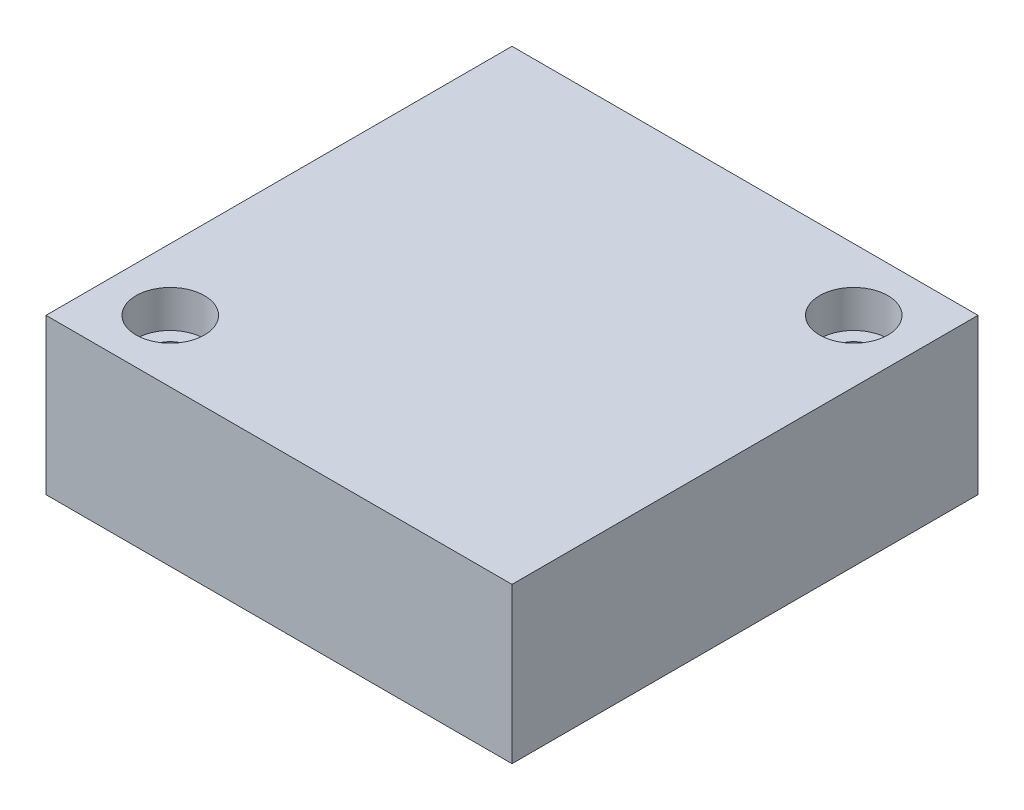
ISO-10303-21;
HEADER;
FILE_DESCRIPTION(('STEP AP214'),'2;1');
FILE_NAME('part.step','',(''),(''),'','','');
FILE_SCHEMA(('AUTOMOTIVE_DESIGN { 1 0 10303 214 1 1 1 1 }'));
ENDSEC;
DATA;
#1=APPLICATION_CONTEXT('core data for automotive mechanical design processes');
#2=APPLICATION_PROTOCOL_DEFINITION('international standard','automotive_design',2000,#1);
#3=PRODUCT_CONTEXT('',#1,'mechanical');
#4=PRODUCT('Part','Part','',(#3));
#5=PRODUCT_RELATED_PRODUCT_CATEGORY('part','',(#4));
#6=PRODUCT_DEFINITION_FORMATION('','',#4);
#7=PRODUCT_DEFINITION_CONTEXT('part definition',#1,'design');
#8=PRODUCT_DEFINITION('design','',#6,#7);
#9=PRODUCT_DEFINITION_SHAPE('','',#8);
#10=(LENGTH_UNIT() NAMED_UNIT(*) SI_UNIT(.MILLI.,.METRE.));
#11=(NAMED_UNIT(*) PLANE_ANGLE_UNIT() SI_UNIT($,.RADIAN.));
#12=(NAMED_UNIT(*) SI_UNIT($,.STERADIAN.) SOLID_ANGLE_UNIT());
#13=UNCERTAINTY_MEASURE_WITH_UNIT(LENGTH_MEASURE(1.E-05),#10,'distance_accuracy_value','');
#14=(GEOMETRIC_REPRESENTATION_CONTEXT(3) GLOBAL_UNCERTAINTY_ASSIGNED_CONTEXT((#13)) GLOBAL_UNIT_ASSIGNED_CONTEXT((#10,
#11,#12)) REPRESENTATION_CONTEXT('',''));
#15=CARTESIAN_POINT('',(0.,0.,0.));
#16=DIRECTION('',(0.,0.,1.));
#17=DIRECTION('',(1.,0.,0.));
#18=AXIS2_PLACEMENT_3D('',#15,#16,#17);
#19=CARTESIAN_POINT('',(37.5,25.,37.5));
#20=DIRECTION('',(-1.,0.,0.));
#21=DIRECTION('',(0.,0.,1.));
#22=AXIS2_PLACEMENT_3D('',#19,#20,#21);
#23=PLANE('',#22);
#24=DIRECTION('',(0.,0.,-1.));
#25=VECTOR('',#24,1.);
#26=CARTESIAN_POINT('',(37.5,0.,37.5));
#27=LINE('',#26,#25);
#28=CARTESIAN_POINT('',(37.5,0.,37.5));
#29=VERTEX_POINT('',#28);
#30=CARTESIAN_POINT('',(37.5,0.,-37.5));
#31=VERTEX_POINT('',#30);
#32=EDGE_CURVE('E113',#29,#31,#27,.T.);
#33=ORIENTED_EDGE('',*,*,#32,.T.);
#34=DIRECTION('',(0.,-1.,0.));
#35=VECTOR('',#34,1.);
#36=CARTESIAN_POINT('',(37.5,25.,-37.5));
#37=LINE('',#36,#35);
#38=CARTESIAN_POINT('',(37.5,25.,-37.5));
#39=VERTEX_POINT('',#38);
#40=EDGE_CURVE('E11',#39,#31,#37,.T.);
#41=ORIENTED_EDGE('',*,*,#40,.F.);
#42=DIRECTION('',(0.,0.,-1.));
#43=VECTOR('',#42,1.);
#44=CARTESIAN_POINT('',(37.5,25.,37.5));
#45=LINE('',#44,#43);
#46=CARTESIAN_POINT('',(37.5,25.,37.5));
#47=VERTEX_POINT('',#46);
#48=EDGE_CURVE('E97',#47,#39,#45,.T.);
#49=ORIENTED_EDGE('',*,*,#48,.F.);
#50=DIRECTION('',(0.,-1.,0.));
#51=VECTOR('',#50,1.);
#52=CARTESIAN_POINT('',(37.5,25.,37.5));
#53=LINE('',#52,#51);
#54=EDGE_CURVE('E109',#47,#29,#53,.T.);
#55=ORIENTED_EDGE('',*,*,#54,.T.);
#56=EDGE_LOOP('',(#33,#41,#49,#55));
#57=FACE_BOUND('',#56,.T.);
#58=ADVANCED_FACE('F45',(#57),#23,.F.);
#59=CARTESIAN_POINT('',(-37.5,25.,-37.5));
#60=DIRECTION('',(0.,0.,1.));
#61=DIRECTION('',(1.,0.,0.));
#62=AXIS2_PLACEMENT_3D('',#59,#60,#61);
#63=PLANE('',#62);
#64=DIRECTION('',(-1.,0.,0.));
#65=VECTOR('',#64,1.);
#66=CARTESIAN_POINT('',(-37.5,0.,-37.5));
#67=LINE('',#66,#65);
#68=CARTESIAN_POINT('',(-37.5,0.,-37.5));
#69=VERTEX_POINT('',#68);
#70=EDGE_CURVE('E102',#31,#69,#67,.T.);
#71=ORIENTED_EDGE('',*,*,#70,.T.);
#72=DIRECTION('',(0.,-1.,0.));
#73=VECTOR('',#72,1.);
#74=CARTESIAN_POINT('',(-37.5,25.,-37.5));
#75=LINE('',#74,#73);
#76=CARTESIAN_POINT('',(-37.5,25.,-37.5));
#77=VERTEX_POINT('',#76);
#78=EDGE_CURVE('E54',#77,#69,#75,.T.);
#79=ORIENTED_EDGE('',*,*,#78,.F.);
#80=DIRECTION('',(-1.,0.,0.));
#81=VECTOR('',#80,1.);
#82=CARTESIAN_POINT('',(-37.5,25.,-37.5));
#83=LINE('',#82,#81);
#84=EDGE_CURVE('E92',#39,#77,#83,.T.);
#85=ORIENTED_EDGE('',*,*,#84,.F.);
#86=ORIENTED_EDGE('',*,*,#40,.T.);
#87=EDGE_LOOP('',(#71,#79,#85,#86));
#88=FACE_BOUND('',#87,.T.);
#89=ADVANCED_FACE('F101',(#88),#63,.F.);
#90=CARTESIAN_POINT('',(-37.5,25.,37.5));
#91=DIRECTION('',(1.,0.,0.));
#92=DIRECTION('',(0.,0.,-1.));
#93=AXIS2_PLACEMENT_3D('',#90,#91,#92);
#94=PLANE('',#93);
#95=DIRECTION('',(0.,0.,1.));
#96=VECTOR('',#95,1.);
#97=CARTESIAN_POINT('',(-37.5,0.,37.5));
#98=LINE('',#97,#96);
#99=CARTESIAN_POINT('',(-37.5,0.,37.5));
#100=VERTEX_POINT('',#99);
#101=EDGE_CURVE('E79',#69,#100,#98,.T.);
#102=ORIENTED_EDGE('',*,*,#101,.T.);
#103=DIRECTION('',(0.,-1.,0.));
#104=VECTOR('',#103,1.);
#105=CARTESIAN_POINT('',(-37.5,25.,37.5));
#106=LINE('',#105,#104);
#107=CARTESIAN_POINT('',(-37.5,25.,37.5));
#108=VERTEX_POINT('',#107);
#109=EDGE_CURVE('E104',#108,#100,#106,.T.);
#110=ORIENTED_EDGE('',*,*,#109,.F.);
#111=DIRECTION('',(0.,0.,1.));
#112=VECTOR('',#111,1.);
#113=CARTESIAN_POINT('',(-37.5,25.,37.5));
#114=LINE('',#113,#112);
#115=EDGE_CURVE('E95',#77,#108,#114,.T.);
#116=ORIENTED_EDGE('',*,*,#115,.F.);
#117=ORIENTED_EDGE('',*,*,#78,.T.);
#118=EDGE_LOOP('',(#102,#110,#116,#117));
#119=FACE_BOUND('',#118,.T.);
#120=ADVANCED_FACE('F105',(#119),#94,.F.);
#121=CARTESIAN_POINT('',(-37.5,25.,37.5));
#122=DIRECTION('',(0.,0.,-1.));
#123=DIRECTION('',(-1.,0.,0.));
#124=AXIS2_PLACEMENT_3D('',#121,#122,#123);
#125=PLANE('',#124);
#126=DIRECTION('',(1.,0.,0.));
#127=VECTOR('',#126,1.);
#128=CARTESIAN_POINT('',(-37.5,0.,37.5));
#129=LINE('',#128,#127);
#130=EDGE_CURVE('E85',#100,#29,#129,.T.);
#131=ORIENTED_EDGE('',*,*,#130,.T.);
#132=ORIENTED_EDGE('',*,*,#54,.F.);
#133=DIRECTION('',(1.,0.,0.));
#134=VECTOR('',#133,1.);
#135=CARTESIAN_POINT('',(-37.5,25.,37.5));
#136=LINE('',#135,#134);
#137=EDGE_CURVE('E62',#108,#47,#136,.T.);
#138=ORIENTED_EDGE('',*,*,#137,.F.);
#139=ORIENTED_EDGE('',*,*,#109,.T.);
#140=EDGE_LOOP('',(#131,#132,#138,#139));
#141=FACE_BOUND('',#140,.T.);
#142=ADVANCED_FACE('F127',(#141),#125,.F.);
#143=CARTESIAN_POINT('',(0.,25.,0.));
#144=DIRECTION('',(0.,-1.,0.));
#145=DIRECTION('',(0.,0.,-1.));
#146=AXIS2_PLACEMENT_3D('',#143,#144,#145);
#147=PLANE('',#146);
#148=CARTESIAN_POINT('',(-27.5,25.,27.5));
#149=DIRECTION('',(0.,1.,0.));
#150=DIRECTION('',(0.,0.,1.));
#151=AXIS2_PLACEMENT_3D('',#148,#149,#150);
#152=CIRCLE('',#151,5.5);
#153=CARTESIAN_POINT('',(-27.5,25.,33.));
#154=VERTEX_POINT('',#153);
#155=EDGE_CURVE('E161',#154,#154,#152,.T.);
#156=ORIENTED_EDGE('',*,*,#155,.F.);
#157=EDGE_LOOP('',(#156));
#158=FACE_BOUND('',#157,.T.);
#159=CARTESIAN_POINT('',(27.5,25.,-27.5));
#160=DIRECTION('',(0.,1.,0.));
#161=DIRECTION('',(0.,0.,1.));
#162=AXIS2_PLACEMENT_3D('',#159,#160,#161);
#163=CIRCLE('',#162,5.5);
#164=CARTESIAN_POINT('',(27.5,25.,-22.));
#165=VERTEX_POINT('',#164);
#166=EDGE_CURVE('E145',#165,#165,#163,.T.);
#167=ORIENTED_EDGE('',*,*,#166,.F.);
#168=EDGE_LOOP('',(#167));
#169=FACE_BOUND('',#168,.T.);
#170=ORIENTED_EDGE('',*,*,#48,.T.);
#171=ORIENTED_EDGE('',*,*,#84,.T.);
#172=ORIENTED_EDGE('',*,*,#115,.T.);
#173=ORIENTED_EDGE('',*,*,#137,.T.);
#174=EDGE_LOOP('',(#170,#171,#172,#173));
#175=FACE_BOUND('',#174,.T.);
#176=ADVANCED_FACE('F93',(#158,#169,#175),#147,.F.);
#177=CARTESIAN_POINT('',(0.,0.,0.));
#178=DIRECTION('',(0.,-1.,0.));
#179=DIRECTION('',(0.,0.,-1.));
#180=AXIS2_PLACEMENT_3D('',#177,#178,#179);
#181=PLANE('',#180);
#182=CARTESIAN_POINT('',(-27.5,0.,27.5));
#183=DIRECTION('',(0.,1.,0.));
#184=DIRECTION('',(0.,0.,1.));
#185=AXIS2_PLACEMENT_3D('',#182,#183,#184);
#186=CIRCLE('',#185,3.29999999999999);
#187=CARTESIAN_POINT('',(-27.5,0.,30.8));
#188=VERTEX_POINT('',#187);
#189=EDGE_CURVE('E149',#188,#188,#186,.T.);
#190=ORIENTED_EDGE('',*,*,#189,.T.);
#191=EDGE_LOOP('',(#190));
#192=FACE_BOUND('',#191,.T.);
#193=CARTESIAN_POINT('',(27.5,0.,-27.5));
#194=DIRECTION('',(0.,1.,0.));
#195=DIRECTION('',(0.,0.,1.));
#196=AXIS2_PLACEMENT_3D('',#193,#194,#195);
#197=CIRCLE('',#196,3.29999999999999);
#198=CARTESIAN_POINT('',(27.5,0.,-24.2));
#199=VERTEX_POINT('',#198);
#200=EDGE_CURVE('E117',#199,#199,#197,.T.);
#201=ORIENTED_EDGE('',*,*,#200,.T.);
#202=EDGE_LOOP('',(#201));
#203=FACE_BOUND('',#202,.T.);
#204=ORIENTED_EDGE('',*,*,#32,.F.);
#205=ORIENTED_EDGE('',*,*,#130,.F.);
#206=ORIENTED_EDGE('',*,*,#101,.F.);
#207=ORIENTED_EDGE('',*,*,#70,.F.);
#208=EDGE_LOOP('',(#204,#205,#206,#207));
#209=FACE_BOUND('',#208,.T.);
#210=ADVANCED_FACE('F130',(#192,#203,#209),#181,.T.);
#211=CARTESIAN_POINT('',(27.5,25.,-27.5));
#212=DIRECTION('',(0.,1.,0.));
#213=DIRECTION('',(0.,0.,1.));
#214=AXIS2_PLACEMENT_3D('',#211,#212,#213);
#215=CYLINDRICAL_SURFACE('',#214,3.3);
#216=ORIENTED_EDGE('',*,*,#200,.F.);
#217=EDGE_LOOP('',(#216));
#218=FACE_BOUND('',#217,.T.);
#219=CARTESIAN_POINT('',(27.5,19.,-27.5));
#220=DIRECTION('',(0.,1.,0.));
#221=DIRECTION('',(0.,0.,1.));
#222=AXIS2_PLACEMENT_3D('',#219,#220,#221);
#223=CIRCLE('',#222,3.3);
#224=CARTESIAN_POINT('',(27.5,19.,-24.2));
#225=VERTEX_POINT('',#224);
#226=EDGE_CURVE('E137',#225,#225,#223,.T.);
#227=ORIENTED_EDGE('',*,*,#226,.T.);
#228=EDGE_LOOP('',(#227));
#229=FACE_BOUND('',#228,.T.);
#230=ADVANCED_FACE('F186',(#218,#229),#215,.F.);
#231=CARTESIAN_POINT('',(30.8,19.,-27.5));
#232=DIRECTION('',(0.,-1.,0.));
#233=DIRECTION('',(0.,0.,-1.));
#234=AXIS2_PLACEMENT_3D('',#231,#232,#233);
#235=PLANE('',#234);
#236=ORIENTED_EDGE('',*,*,#226,.F.);
#237=EDGE_LOOP('',(#236));
#238=FACE_BOUND('',#237,.T.);
#239=CARTESIAN_POINT('',(27.5,19.,-27.5));
#240=DIRECTION('',(0.,1.,0.));
#241=DIRECTION('',(0.,0.,1.));
#242=AXIS2_PLACEMENT_3D('',#239,#240,#241);
#243=CIRCLE('',#242,5.5);
#244=CARTESIAN_POINT('',(27.5,19.,-22.));
#245=VERTEX_POINT('',#244);
#246=EDGE_CURVE('E141',#245,#245,#243,.T.);
#247=ORIENTED_EDGE('',*,*,#246,.T.);
#248=EDGE_LOOP('',(#247));
#249=FACE_BOUND('',#248,.T.);
#250=ADVANCED_FACE('F176',(#238,#249),#235,.F.);
#251=CARTESIAN_POINT('',(27.5,25.,-27.5));
#252=DIRECTION('',(0.,1.,0.));
#253=DIRECTION('',(0.,0.,1.));
#254=AXIS2_PLACEMENT_3D('',#251,#252,#253);
#255=CYLINDRICAL_SURFACE('',#254,5.5);
#256=ORIENTED_EDGE('',*,*,#246,.F.);
#257=EDGE_LOOP('',(#256));
#258=FACE_BOUND('',#257,.T.);
#259=ORIENTED_EDGE('',*,*,#166,.T.);
#260=EDGE_LOOP('',(#259));
#261=FACE_BOUND('',#260,.T.);
#262=ADVANCED_FACE('F173',(#258,#261),#255,.F.);
#263=CARTESIAN_POINT('',(-27.5,25.,27.5));
#264=DIRECTION('',(0.,1.,0.));
#265=DIRECTION('',(0.,0.,1.));
#266=AXIS2_PLACEMENT_3D('',#263,#264,#265);
#267=CYLINDRICAL_SURFACE('',#266,3.3);
#268=ORIENTED_EDGE('',*,*,#189,.F.);
#269=EDGE_LOOP('',(#268));
#270=FACE_BOUND('',#269,.T.);
#271=CARTESIAN_POINT('',(-27.5,19.,27.5));
#272=DIRECTION('',(0.,1.,0.));
#273=DIRECTION('',(0.,0.,1.));
#274=AXIS2_PLACEMENT_3D('',#271,#272,#273);
#275=CIRCLE('',#274,3.3);
#276=CARTESIAN_POINT('',(-27.5,19.,30.8));
#277=VERTEX_POINT('',#276);
#278=EDGE_CURVE('E153',#277,#277,#275,.T.);
#279=ORIENTED_EDGE('',*,*,#278,.T.);
#280=EDGE_LOOP('',(#279));
#281=FACE_BOUND('',#280,.T.);
#282=ADVANCED_FACE('F175',(#270,#281),#267,.F.);
#283=CARTESIAN_POINT('',(-24.2,19.,27.5));
#284=DIRECTION('',(0.,-1.,0.));
#285=DIRECTION('',(0.,0.,-1.));
#286=AXIS2_PLACEMENT_3D('',#283,#284,#285);
#287=PLANE('',#286);
#288=ORIENTED_EDGE('',*,*,#278,.F.);
#289=EDGE_LOOP('',(#288));
#290=FACE_BOUND('',#289,.T.);
#291=CARTESIAN_POINT('',(-27.5,19.,27.5));
#292=DIRECTION('',(0.,1.,0.));
#293=DIRECTION('',(0.,0.,1.));
#294=AXIS2_PLACEMENT_3D('',#291,#292,#293);
#295=CIRCLE('',#294,5.5);
#296=CARTESIAN_POINT('',(-27.5,19.,33.));
#297=VERTEX_POINT('',#296);
#298=EDGE_CURVE('E157',#297,#297,#295,.T.);
#299=ORIENTED_EDGE('',*,*,#298,.T.);
#300=EDGE_LOOP('',(#299));
#301=FACE_BOUND('',#300,.T.);
#302=ADVANCED_FACE('F183',(#290,#301),#287,.F.);
#303=CARTESIAN_POINT('',(-27.5,25.,27.5));
#304=DIRECTION('',(0.,1.,0.));
#305=DIRECTION('',(0.,0.,1.));
#306=AXIS2_PLACEMENT_3D('',#303,#304,#305);
#307=CYLINDRICAL_SURFACE('',#306,5.5);
#308=ORIENTED_EDGE('',*,*,#298,.F.);
#309=EDGE_LOOP('',(#308));
#310=FACE_BOUND('',#309,.T.);
#311=ORIENTED_EDGE('',*,*,#155,.T.);
#312=EDGE_LOOP('',(#311));
#313=FACE_BOUND('',#312,.T.);
#314=ADVANCED_FACE('F166',(#310,#313),#307,.F.);
#315=CLOSED_SHELL('',(#58,#89,#120,#142,#176,#210,#230,#250,#262,#282,#302,#314));
#316=MANIFOLD_SOLID_BREP('B2',#315);
#317=ADVANCED_BREP_SHAPE_REPRESENTATION('',(#18,#316),#14);
#318=SHAPE_DEFINITION_REPRESENTATION(#9,#317);
ENDSEC;
END-ISO-10303-21;
